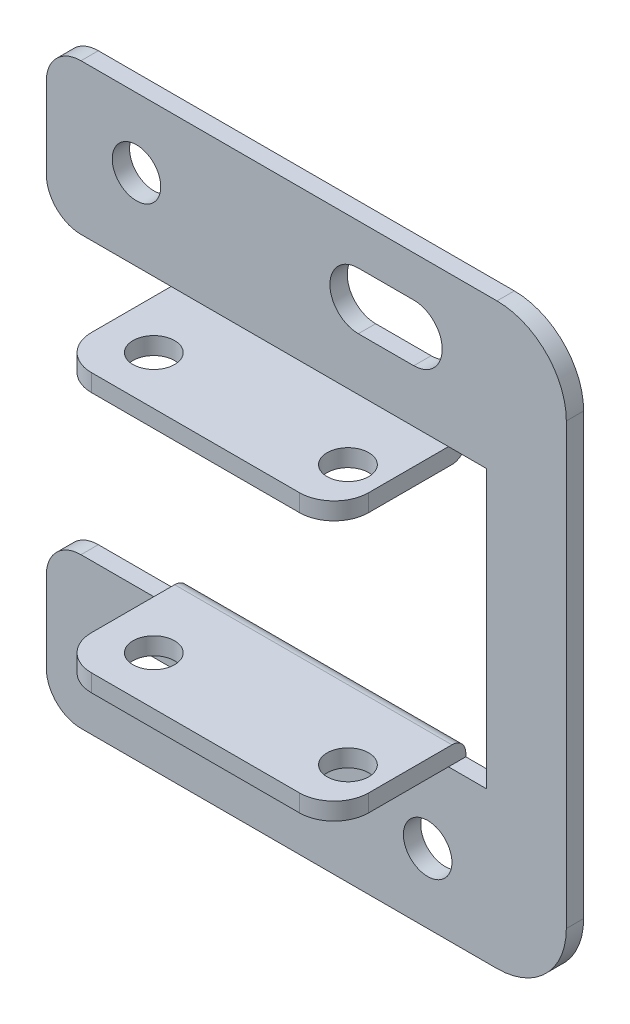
ISO-10303-21;
HEADER;
FILE_DESCRIPTION(('STEP AP214'),'2;1');
FILE_NAME('part.step','',(''),(''),'','','');
FILE_SCHEMA(('AUTOMOTIVE_DESIGN { 1 0 10303 214 1 1 1 1 }'));
ENDSEC;
DATA;
#1=APPLICATION_CONTEXT('core data for automotive mechanical design processes');
#2=APPLICATION_PROTOCOL_DEFINITION('international standard','automotive_design',2000,#1);
#3=PRODUCT_CONTEXT('',#1,'mechanical');
#4=PRODUCT('Part','Part','',(#3));
#5=PRODUCT_RELATED_PRODUCT_CATEGORY('part','',(#4));
#6=PRODUCT_DEFINITION_FORMATION('','',#4);
#7=PRODUCT_DEFINITION_CONTEXT('part definition',#1,'design');
#8=PRODUCT_DEFINITION('design','',#6,#7);
#9=PRODUCT_DEFINITION_SHAPE('','',#8);
#10=(LENGTH_UNIT() NAMED_UNIT(*) SI_UNIT(.MILLI.,.METRE.));
#11=(NAMED_UNIT(*) PLANE_ANGLE_UNIT() SI_UNIT($,.RADIAN.));
#12=(NAMED_UNIT(*) SI_UNIT($,.STERADIAN.) SOLID_ANGLE_UNIT());
#13=UNCERTAINTY_MEASURE_WITH_UNIT(LENGTH_MEASURE(1.E-05),#10,'distance_accuracy_value','');
#14=(GEOMETRIC_REPRESENTATION_CONTEXT(3) GLOBAL_UNCERTAINTY_ASSIGNED_CONTEXT((#13)) GLOBAL_UNIT_ASSIGNED_CONTEXT((#10,
#11,#12)) REPRESENTATION_CONTEXT('',''));
#15=CARTESIAN_POINT('',(0.,0.,0.));
#16=DIRECTION('',(0.,0.,1.));
#17=DIRECTION('',(1.,0.,0.));
#18=AXIS2_PLACEMENT_3D('',#15,#16,#17);
#19=CARTESIAN_POINT('',(9.00000000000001,-10.,7.));
#20=DIRECTION('',(-1.,0.,0.));
#21=DIRECTION('',(0.,0.,1.));
#22=AXIS2_PLACEMENT_3D('',#19,#20,#21);
#23=PLANE('',#22);
#24=DIRECTION('',(0.,1.,0.));
#25=VECTOR('',#24,1.);
#26=CARTESIAN_POINT('',(9.00000000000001,-10.,7.));
#27=LINE('',#26,#25);
#28=CARTESIAN_POINT('',(9.00000000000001,-8.75,7.));
#29=VERTEX_POINT('',#28);
#30=CARTESIAN_POINT('',(9.00000000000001,-10.,7.));
#31=VERTEX_POINT('',#30);
#32=EDGE_CURVE('E276',#29,#31,#27,.F.);
#33=ORIENTED_EDGE('',*,*,#32,.F.);
#34=DIRECTION('',(0.,0.,1.));
#35=VECTOR('',#34,1.);
#36=CARTESIAN_POINT('',(9.00000000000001,-8.75,4.55043997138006));
#37=LINE('',#36,#35);
#38=CARTESIAN_POINT('',(9.00000000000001,-8.75,1.));
#39=VERTEX_POINT('',#38);
#40=EDGE_CURVE('E320',#39,#29,#37,.T.);
#41=ORIENTED_EDGE('',*,*,#40,.F.);
#42=CARTESIAN_POINT('',(9.00000000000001,-9.75,1.));
#43=DIRECTION('',(1.,0.,0.));
#44=DIRECTION('',(0.,1.,0.));
#45=AXIS2_PLACEMENT_3D('',#42,#43,#44);
#46=CIRCLE('',#45,1.);
#47=CARTESIAN_POINT('',(9.00000000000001,-9.75,0.));
#48=VERTEX_POINT('',#47);
#49=EDGE_CURVE('E19',#39,#48,#46,.F.);
#50=ORIENTED_EDGE('',*,*,#49,.T.);
#51=DIRECTION('',(0.,1.,0.));
#52=VECTOR('',#51,1.);
#53=CARTESIAN_POINT('',(9.00000000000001,-10.,0.));
#54=LINE('',#53,#52);
#55=CARTESIAN_POINT('',(9.00000000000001,-10.,0.));
#56=VERTEX_POINT('',#55);
#57=EDGE_CURVE('E271',#48,#56,#54,.F.);
#58=ORIENTED_EDGE('',*,*,#57,.T.);
#59=DIRECTION('',(0.,0.,1.));
#60=VECTOR('',#59,1.);
#61=CARTESIAN_POINT('',(9.00000000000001,-10.,7.));
#62=LINE('',#61,#60);
#63=CARTESIAN_POINT('',(9.00000000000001,-10.,1.25));
#64=VERTEX_POINT('',#63);
#65=EDGE_CURVE('E266',#56,#64,#62,.T.);
#66=ORIENTED_EDGE('',*,*,#65,.T.);
#67=DIRECTION('',(0.,0.,1.));
#68=VECTOR('',#67,1.);
#69=CARTESIAN_POINT('',(9.00000000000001,-10.,4.55043997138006));
#70=LINE('',#69,#68);
#71=EDGE_CURVE('E269',#64,#31,#70,.T.);
#72=ORIENTED_EDGE('',*,*,#71,.T.);
#73=EDGE_LOOP('',(#33,#41,#50,#58,#66,#72));
#74=FACE_BOUND('',#73,.T.);
#75=ADVANCED_FACE('F15',(#74),#23,.T.);
#76=CARTESIAN_POINT('',(11.5,-10.,7.));
#77=DIRECTION('',(0.,1.,0.));
#78=DIRECTION('',(0.,0.,1.));
#79=AXIS2_PLACEMENT_3D('',#76,#77,#78);
#80=CYLINDRICAL_SURFACE('',#79,2.5);
#81=CARTESIAN_POINT('',(11.5,-10.,7.));
#82=DIRECTION('',(0.,1.,0.));
#83=DIRECTION('',(0.,0.,1.));
#84=AXIS2_PLACEMENT_3D('',#81,#82,#83);
#85=CIRCLE('',#84,2.5);
#86=CARTESIAN_POINT('',(11.5,-10.,9.5));
#87=VERTEX_POINT('',#86);
#88=EDGE_CURVE('E287',#31,#87,#85,.T.);
#89=ORIENTED_EDGE('',*,*,#88,.T.);
#90=DIRECTION('',(0.,1.,0.));
#91=VECTOR('',#90,1.);
#92=CARTESIAN_POINT('',(11.5,-10.,9.5));
#93=LINE('',#92,#91);
#94=CARTESIAN_POINT('',(11.5,-8.75,9.5));
#95=VERTEX_POINT('',#94);
#96=EDGE_CURVE('E378',#95,#87,#93,.F.);
#97=ORIENTED_EDGE('',*,*,#96,.F.);
#98=CARTESIAN_POINT('',(11.5,-8.75,7.));
#99=DIRECTION('',(0.,1.,0.));
#100=DIRECTION('',(0.,0.,1.));
#101=AXIS2_PLACEMENT_3D('',#98,#99,#100);
#102=CIRCLE('',#101,2.5);
#103=EDGE_CURVE('E319',#29,#95,#102,.T.);
#104=ORIENTED_EDGE('',*,*,#103,.F.);
#105=ORIENTED_EDGE('',*,*,#32,.T.);
#106=EDGE_LOOP('',(#89,#97,#104,#105));
#107=FACE_BOUND('',#106,.T.);
#108=ADVANCED_FACE('F778',(#107),#80,.T.);
#109=CARTESIAN_POINT('',(26.5,-10.,9.5));
#110=DIRECTION('',(0.,0.,1.));
#111=DIRECTION('',(1.,0.,0.));
#112=AXIS2_PLACEMENT_3D('',#109,#110,#111);
#113=PLANE('',#112);
#114=DIRECTION('',(1.,0.,0.));
#115=VECTOR('',#114,1.);
#116=CARTESIAN_POINT('',(19.,-10.,9.5));
#117=LINE('',#116,#115);
#118=CARTESIAN_POINT('',(26.5,-10.,9.5));
#119=VERTEX_POINT('',#118);
#120=EDGE_CURVE('E345',#87,#119,#117,.T.);
#121=ORIENTED_EDGE('',*,*,#120,.T.);
#122=DIRECTION('',(0.,1.,0.));
#123=VECTOR('',#122,1.);
#124=CARTESIAN_POINT('',(26.5,-10.,9.5));
#125=LINE('',#124,#123);
#126=CARTESIAN_POINT('',(26.5,-8.75,9.5));
#127=VERTEX_POINT('',#126);
#128=EDGE_CURVE('E376',#127,#119,#125,.F.);
#129=ORIENTED_EDGE('',*,*,#128,.F.);
#130=DIRECTION('',(1.,0.,0.));
#131=VECTOR('',#130,1.);
#132=CARTESIAN_POINT('',(19.,-8.75,9.5));
#133=LINE('',#132,#131);
#134=EDGE_CURVE('E317',#95,#127,#133,.T.);
#135=ORIENTED_EDGE('',*,*,#134,.F.);
#136=ORIENTED_EDGE('',*,*,#96,.T.);
#137=EDGE_LOOP('',(#121,#129,#135,#136));
#138=FACE_BOUND('',#137,.T.);
#139=ADVANCED_FACE('F774',(#138),#113,.T.);
#140=CARTESIAN_POINT('',(26.5,-10.,7.));
#141=DIRECTION('',(0.,1.,0.));
#142=DIRECTION('',(0.,0.,1.));
#143=AXIS2_PLACEMENT_3D('',#140,#141,#142);
#144=CYLINDRICAL_SURFACE('',#143,2.5);
#145=CARTESIAN_POINT('',(26.5,-10.,7.));
#146=DIRECTION('',(0.,1.,0.));
#147=DIRECTION('',(0.,0.,1.));
#148=AXIS2_PLACEMENT_3D('',#145,#146,#147);
#149=CIRCLE('',#148,2.5);
#150=CARTESIAN_POINT('',(29.,-10.,7.));
#151=VERTEX_POINT('',#150);
#152=EDGE_CURVE('E344',#119,#151,#149,.T.);
#153=ORIENTED_EDGE('',*,*,#152,.T.);
#154=DIRECTION('',(0.,1.,0.));
#155=VECTOR('',#154,1.);
#156=CARTESIAN_POINT('',(29.,-10.,7.));
#157=LINE('',#156,#155);
#158=CARTESIAN_POINT('',(29.,-8.75,7.));
#159=VERTEX_POINT('',#158);
#160=EDGE_CURVE('E373',#159,#151,#157,.F.);
#161=ORIENTED_EDGE('',*,*,#160,.F.);
#162=CARTESIAN_POINT('',(26.5,-8.75,7.));
#163=DIRECTION('',(0.,1.,0.));
#164=DIRECTION('',(0.,0.,1.));
#165=AXIS2_PLACEMENT_3D('',#162,#163,#164);
#166=CIRCLE('',#165,2.5);
#167=EDGE_CURVE('E316',#127,#159,#166,.T.);
#168=ORIENTED_EDGE('',*,*,#167,.F.);
#169=ORIENTED_EDGE('',*,*,#128,.T.);
#170=EDGE_LOOP('',(#153,#161,#168,#169));
#171=FACE_BOUND('',#170,.T.);
#172=ADVANCED_FACE('F771',(#171),#144,.T.);
#173=CARTESIAN_POINT('',(29.,-10.,0.));
#174=DIRECTION('',(1.,0.,0.));
#175=DIRECTION('',(0.,0.,-1.));
#176=AXIS2_PLACEMENT_3D('',#173,#174,#175);
#177=PLANE('',#176);
#178=DIRECTION('',(0.,0.,-1.));
#179=VECTOR('',#178,1.);
#180=CARTESIAN_POINT('',(29.,-10.,0.));
#181=LINE('',#180,#179);
#182=CARTESIAN_POINT('',(29.,-10.,1.25));
#183=VERTEX_POINT('',#182);
#184=CARTESIAN_POINT('',(29.,-10.,0.));
#185=VERTEX_POINT('',#184);
#186=EDGE_CURVE('E372',#183,#185,#181,.T.);
#187=ORIENTED_EDGE('',*,*,#186,.T.);
#188=DIRECTION('',(0.,1.,0.));
#189=VECTOR('',#188,1.);
#190=CARTESIAN_POINT('',(29.,-10.,0.));
#191=LINE('',#190,#189);
#192=CARTESIAN_POINT('',(29.,-9.75,0.));
#193=VERTEX_POINT('',#192);
#194=EDGE_CURVE('E370',#185,#193,#191,.T.);
#195=ORIENTED_EDGE('',*,*,#194,.T.);
#196=CARTESIAN_POINT('',(29.,-9.75,1.));
#197=DIRECTION('',(1.,0.,0.));
#198=DIRECTION('',(0.,1.,0.));
#199=AXIS2_PLACEMENT_3D('',#196,#197,#198);
#200=CIRCLE('',#199,1.);
#201=CARTESIAN_POINT('',(29.,-8.75,1.));
#202=VERTEX_POINT('',#201);
#203=EDGE_CURVE('E374',#193,#202,#200,.T.);
#204=ORIENTED_EDGE('',*,*,#203,.T.);
#205=DIRECTION('',(0.,0.,1.));
#206=VECTOR('',#205,1.);
#207=CARTESIAN_POINT('',(29.,-8.75,4.55043997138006));
#208=LINE('',#207,#206);
#209=EDGE_CURVE('E312',#159,#202,#208,.F.);
#210=ORIENTED_EDGE('',*,*,#209,.F.);
#211=ORIENTED_EDGE('',*,*,#160,.T.);
#212=DIRECTION('',(0.,0.,1.));
#213=VECTOR('',#212,1.);
#214=CARTESIAN_POINT('',(29.,-10.,4.55043997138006));
#215=LINE('',#214,#213);
#216=EDGE_CURVE('E340',#151,#183,#215,.F.);
#217=ORIENTED_EDGE('',*,*,#216,.T.);
#218=EDGE_LOOP('',(#187,#195,#204,#210,#211,#217));
#219=FACE_BOUND('',#218,.T.);
#220=ADVANCED_FACE('F517',(#219),#177,.T.);
#221=CARTESIAN_POINT('',(26.5,-10.,6.));
#222=DIRECTION('',(0.,1.,0.));
#223=DIRECTION('',(0.,0.,1.));
#224=AXIS2_PLACEMENT_3D('',#221,#222,#223);
#225=CYLINDRICAL_SURFACE('',#224,1.5);
#226=CARTESIAN_POINT('',(26.5,-10.,6.));
#227=DIRECTION('',(0.,1.,0.));
#228=DIRECTION('',(0.,0.,1.));
#229=AXIS2_PLACEMENT_3D('',#226,#227,#228);
#230=CIRCLE('',#229,1.5);
#231=CARTESIAN_POINT('',(26.5,-10.,7.5));
#232=VERTEX_POINT('',#231);
#233=EDGE_CURVE('E335',#232,#232,#230,.F.);
#234=ORIENTED_EDGE('',*,*,#233,.T.);
#235=EDGE_LOOP('',(#234));
#236=FACE_BOUND('',#235,.T.);
#237=CARTESIAN_POINT('',(26.5,-8.75,6.));
#238=DIRECTION('',(0.,1.,0.));
#239=DIRECTION('',(0.,0.,1.));
#240=AXIS2_PLACEMENT_3D('',#237,#238,#239);
#241=CIRCLE('',#240,1.5);
#242=CARTESIAN_POINT('',(26.5,-8.75,7.5));
#243=VERTEX_POINT('',#242);
#244=EDGE_CURVE('E315',#243,#243,#241,.F.);
#245=ORIENTED_EDGE('',*,*,#244,.F.);
#246=EDGE_LOOP('',(#245));
#247=FACE_BOUND('',#246,.T.);
#248=ADVANCED_FACE('F764',(#236,#247),#225,.F.);
#249=CARTESIAN_POINT('',(12.5,-10.,6.));
#250=DIRECTION('',(0.,1.,0.));
#251=DIRECTION('',(0.,0.,1.));
#252=AXIS2_PLACEMENT_3D('',#249,#250,#251);
#253=CYLINDRICAL_SURFACE('',#252,1.5);
#254=CARTESIAN_POINT('',(12.5,-10.,6.));
#255=DIRECTION('',(0.,1.,0.));
#256=DIRECTION('',(0.,0.,1.));
#257=AXIS2_PLACEMENT_3D('',#254,#255,#256);
#258=CIRCLE('',#257,1.5);
#259=CARTESIAN_POINT('',(12.5,-10.,7.5));
#260=VERTEX_POINT('',#259);
#261=EDGE_CURVE('E343',#260,#260,#258,.F.);
#262=ORIENTED_EDGE('',*,*,#261,.T.);
#263=EDGE_LOOP('',(#262));
#264=FACE_BOUND('',#263,.T.);
#265=CARTESIAN_POINT('',(12.5,-8.75,6.));
#266=DIRECTION('',(0.,1.,0.));
#267=DIRECTION('',(0.,0.,1.));
#268=AXIS2_PLACEMENT_3D('',#265,#266,#267);
#269=CIRCLE('',#268,1.5);
#270=CARTESIAN_POINT('',(12.5,-8.75,7.5));
#271=VERTEX_POINT('',#270);
#272=EDGE_CURVE('E491',#271,#271,#269,.F.);
#273=ORIENTED_EDGE('',*,*,#272,.F.);
#274=EDGE_LOOP('',(#273));
#275=FACE_BOUND('',#274,.T.);
#276=ADVANCED_FACE('F760',(#264,#275),#253,.F.);
#277=CARTESIAN_POINT('',(29.,8.75,7.));
#278=DIRECTION('',(1.,0.,0.));
#279=DIRECTION('',(0.,0.,-1.));
#280=AXIS2_PLACEMENT_3D('',#277,#278,#279);
#281=PLANE('',#280);
#282=DIRECTION('',(0.,1.,0.));
#283=VECTOR('',#282,1.);
#284=CARTESIAN_POINT('',(29.,9.375,7.));
#285=LINE('',#284,#283);
#286=CARTESIAN_POINT('',(29.,8.75,7.));
#287=VERTEX_POINT('',#286);
#288=CARTESIAN_POINT('',(29.,10.,7.));
#289=VERTEX_POINT('',#288);
#290=EDGE_CURVE('E364',#287,#289,#285,.T.);
#291=ORIENTED_EDGE('',*,*,#290,.F.);
#292=DIRECTION('',(0.,0.,1.));
#293=VECTOR('',#292,1.);
#294=CARTESIAN_POINT('',(29.,8.75,5.25));
#295=LINE('',#294,#293);
#296=CARTESIAN_POINT('',(29.,8.75,1.));
#297=VERTEX_POINT('',#296);
#298=EDGE_CURVE('E490',#297,#287,#295,.T.);
#299=ORIENTED_EDGE('',*,*,#298,.F.);
#300=CARTESIAN_POINT('',(29.,9.75,1.));
#301=DIRECTION('',(1.,0.,0.));
#302=DIRECTION('',(0.,1.,0.));
#303=AXIS2_PLACEMENT_3D('',#300,#301,#302);
#304=CIRCLE('',#303,1.);
#305=CARTESIAN_POINT('',(29.,9.75,0.));
#306=VERTEX_POINT('',#305);
#307=EDGE_CURVE('E369',#297,#306,#304,.T.);
#308=ORIENTED_EDGE('',*,*,#307,.T.);
#309=DIRECTION('',(0.,1.,0.));
#310=VECTOR('',#309,1.);
#311=CARTESIAN_POINT('',(29.,9.375,0.));
#312=LINE('',#311,#310);
#313=CARTESIAN_POINT('',(29.,10.,0.));
#314=VERTEX_POINT('',#313);
#315=EDGE_CURVE('E367',#306,#314,#312,.T.);
#316=ORIENTED_EDGE('',*,*,#315,.T.);
#317=DIRECTION('',(0.,0.,1.));
#318=VECTOR('',#317,1.);
#319=CARTESIAN_POINT('',(29.,10.,3.5));
#320=LINE('',#319,#318);
#321=CARTESIAN_POINT('',(29.,10.,1.25));
#322=VERTEX_POINT('',#321);
#323=EDGE_CURVE('E366',#314,#322,#320,.T.);
#324=ORIENTED_EDGE('',*,*,#323,.T.);
#325=DIRECTION('',(0.,0.,1.));
#326=VECTOR('',#325,1.);
#327=CARTESIAN_POINT('',(29.,10.,5.375));
#328=LINE('',#327,#326);
#329=EDGE_CURVE('E332',#322,#289,#328,.T.);
#330=ORIENTED_EDGE('',*,*,#329,.T.);
#331=EDGE_LOOP('',(#291,#299,#308,#316,#324,#330));
#332=FACE_BOUND('',#331,.T.);
#333=ADVANCED_FACE('F763',(#332),#281,.T.);
#334=CARTESIAN_POINT('',(26.5,10.,7.));
#335=DIRECTION('',(0.,-1.,0.));
#336=DIRECTION('',(0.,0.,-1.));
#337=AXIS2_PLACEMENT_3D('',#334,#335,#336);
#338=CYLINDRICAL_SURFACE('',#337,2.5);
#339=CARTESIAN_POINT('',(26.5,10.,7.));
#340=DIRECTION('',(0.,-1.,0.));
#341=DIRECTION('',(0.,0.,-1.));
#342=AXIS2_PLACEMENT_3D('',#339,#340,#341);
#343=CIRCLE('',#342,2.5);
#344=CARTESIAN_POINT('',(26.5,10.,9.5));
#345=VERTEX_POINT('',#344);
#346=EDGE_CURVE('E331',#289,#345,#343,.T.);
#347=ORIENTED_EDGE('',*,*,#346,.T.);
#348=DIRECTION('',(0.,1.,0.));
#349=VECTOR('',#348,1.);
#350=CARTESIAN_POINT('',(26.5,9.375,9.5));
#351=LINE('',#350,#349);
#352=CARTESIAN_POINT('',(26.5,8.75,9.5));
#353=VERTEX_POINT('',#352);
#354=EDGE_CURVE('E362',#353,#345,#351,.T.);
#355=ORIENTED_EDGE('',*,*,#354,.F.);
#356=CARTESIAN_POINT('',(26.5,8.75,7.));
#357=DIRECTION('',(0.,-1.,0.));
#358=DIRECTION('',(0.,0.,-1.));
#359=AXIS2_PLACEMENT_3D('',#356,#357,#358);
#360=CIRCLE('',#359,2.5);
#361=EDGE_CURVE('E488',#287,#353,#360,.T.);
#362=ORIENTED_EDGE('',*,*,#361,.F.);
#363=ORIENTED_EDGE('',*,*,#290,.T.);
#364=EDGE_LOOP('',(#347,#355,#362,#363));
#365=FACE_BOUND('',#364,.T.);
#366=ADVANCED_FACE('F787',(#365),#338,.T.);
#367=CARTESIAN_POINT('',(11.5,8.75,9.5));
#368=DIRECTION('',(0.,0.,1.));
#369=DIRECTION('',(1.,0.,0.));
#370=AXIS2_PLACEMENT_3D('',#367,#368,#369);
#371=PLANE('',#370);
#372=DIRECTION('',(-1.,0.,0.));
#373=VECTOR('',#372,1.);
#374=CARTESIAN_POINT('',(19.,10.,9.5));
#375=LINE('',#374,#373);
#376=CARTESIAN_POINT('',(11.5,10.,9.5));
#377=VERTEX_POINT('',#376);
#378=EDGE_CURVE('E328',#345,#377,#375,.T.);
#379=ORIENTED_EDGE('',*,*,#378,.T.);
#380=DIRECTION('',(0.,1.,0.));
#381=VECTOR('',#380,1.);
#382=CARTESIAN_POINT('',(11.5,9.375,9.5));
#383=LINE('',#382,#381);
#384=CARTESIAN_POINT('',(11.5,8.75,9.5));
#385=VERTEX_POINT('',#384);
#386=EDGE_CURVE('E360',#385,#377,#383,.T.);
#387=ORIENTED_EDGE('',*,*,#386,.F.);
#388=DIRECTION('',(-1.,0.,0.));
#389=VECTOR('',#388,1.);
#390=CARTESIAN_POINT('',(19.,8.75,9.5));
#391=LINE('',#390,#389);
#392=EDGE_CURVE('E487',#353,#385,#391,.T.);
#393=ORIENTED_EDGE('',*,*,#392,.F.);
#394=ORIENTED_EDGE('',*,*,#354,.T.);
#395=EDGE_LOOP('',(#379,#387,#393,#394));
#396=FACE_BOUND('',#395,.T.);
#397=ADVANCED_FACE('F791',(#396),#371,.T.);
#398=CARTESIAN_POINT('',(11.5,10.,7.));
#399=DIRECTION('',(0.,-1.,0.));
#400=DIRECTION('',(0.,0.,-1.));
#401=AXIS2_PLACEMENT_3D('',#398,#399,#400);
#402=CYLINDRICAL_SURFACE('',#401,2.5);
#403=CARTESIAN_POINT('',(11.5,10.,7.));
#404=DIRECTION('',(0.,-1.,0.));
#405=DIRECTION('',(0.,0.,-1.));
#406=AXIS2_PLACEMENT_3D('',#403,#404,#405);
#407=CIRCLE('',#406,2.5);
#408=CARTESIAN_POINT('',(9.00000000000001,10.,7.));
#409=VERTEX_POINT('',#408);
#410=EDGE_CURVE('E327',#377,#409,#407,.T.);
#411=ORIENTED_EDGE('',*,*,#410,.T.);
#412=DIRECTION('',(0.,1.,0.));
#413=VECTOR('',#412,1.);
#414=CARTESIAN_POINT('',(9.00000000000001,9.375,7.));
#415=LINE('',#414,#413);
#416=CARTESIAN_POINT('',(9.00000000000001,8.75,7.));
#417=VERTEX_POINT('',#416);
#418=EDGE_CURVE('E352',#417,#409,#415,.T.);
#419=ORIENTED_EDGE('',*,*,#418,.F.);
#420=CARTESIAN_POINT('',(11.5,8.75,7.));
#421=DIRECTION('',(0.,-1.,0.));
#422=DIRECTION('',(0.,0.,-1.));
#423=AXIS2_PLACEMENT_3D('',#420,#421,#422);
#424=CIRCLE('',#423,2.5);
#425=EDGE_CURVE('E485',#385,#417,#424,.T.);
#426=ORIENTED_EDGE('',*,*,#425,.F.);
#427=ORIENTED_EDGE('',*,*,#386,.T.);
#428=EDGE_LOOP('',(#411,#419,#426,#427));
#429=FACE_BOUND('',#428,.T.);
#430=ADVANCED_FACE('F795',(#429),#402,.T.);
#431=CARTESIAN_POINT('',(9.00000000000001,8.75,0.));
#432=DIRECTION('',(-1.,0.,0.));
#433=DIRECTION('',(0.,0.,1.));
#434=AXIS2_PLACEMENT_3D('',#431,#432,#433);
#435=PLANE('',#434);
#436=DIRECTION('',(0.,0.,-1.));
#437=VECTOR('',#436,1.);
#438=CARTESIAN_POINT('',(9.00000000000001,10.,3.5));
#439=LINE('',#438,#437);
#440=CARTESIAN_POINT('',(9.00000000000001,10.,1.25));
#441=VERTEX_POINT('',#440);
#442=CARTESIAN_POINT('',(9.00000000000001,10.,0.));
#443=VERTEX_POINT('',#442);
#444=EDGE_CURVE('E351',#441,#443,#439,.T.);
#445=ORIENTED_EDGE('',*,*,#444,.T.);
#446=DIRECTION('',(0.,-1.,0.));
#447=VECTOR('',#446,1.);
#448=CARTESIAN_POINT('',(9.00000000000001,9.375,0.));
#449=LINE('',#448,#447);
#450=CARTESIAN_POINT('',(9.00000000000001,9.75,0.));
#451=VERTEX_POINT('',#450);
#452=EDGE_CURVE('E288',#443,#451,#449,.T.);
#453=ORIENTED_EDGE('',*,*,#452,.T.);
#454=CARTESIAN_POINT('',(9.00000000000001,9.75,1.));
#455=DIRECTION('',(1.,0.,0.));
#456=DIRECTION('',(0.,1.,0.));
#457=AXIS2_PLACEMENT_3D('',#454,#455,#456);
#458=CIRCLE('',#457,1.);
#459=CARTESIAN_POINT('',(9.00000000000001,8.75,1.));
#460=VERTEX_POINT('',#459);
#461=EDGE_CURVE('E354',#451,#460,#458,.F.);
#462=ORIENTED_EDGE('',*,*,#461,.T.);
#463=DIRECTION('',(0.,0.,-1.));
#464=VECTOR('',#463,1.);
#465=CARTESIAN_POINT('',(9.00000000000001,8.75,5.25));
#466=LINE('',#465,#464);
#467=EDGE_CURVE('E484',#417,#460,#466,.T.);
#468=ORIENTED_EDGE('',*,*,#467,.F.);
#469=ORIENTED_EDGE('',*,*,#418,.T.);
#470=DIRECTION('',(0.,0.,-1.));
#471=VECTOR('',#470,1.);
#472=CARTESIAN_POINT('',(9.00000000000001,10.,5.375));
#473=LINE('',#472,#471);
#474=EDGE_CURVE('E323',#409,#441,#473,.T.);
#475=ORIENTED_EDGE('',*,*,#474,.T.);
#476=EDGE_LOOP('',(#445,#453,#462,#468,#469,#475));
#477=FACE_BOUND('',#476,.T.);
#478=ADVANCED_FACE('F799',(#477),#435,.T.);
#479=CARTESIAN_POINT('',(12.5,10.,6.));
#480=DIRECTION('',(0.,-1.,0.));
#481=DIRECTION('',(0.,0.,-1.));
#482=AXIS2_PLACEMENT_3D('',#479,#480,#481);
#483=CYLINDRICAL_SURFACE('',#482,1.5);
#484=CARTESIAN_POINT('',(12.5,10.,6.));
#485=DIRECTION('',(0.,-1.,0.));
#486=DIRECTION('',(0.,0.,-1.));
#487=AXIS2_PLACEMENT_3D('',#484,#485,#486);
#488=CIRCLE('',#487,1.5);
#489=CARTESIAN_POINT('',(12.5,10.,4.5));
#490=VERTEX_POINT('',#489);
#491=EDGE_CURVE('E322',#490,#490,#488,.F.);
#492=ORIENTED_EDGE('',*,*,#491,.T.);
#493=EDGE_LOOP('',(#492));
#494=FACE_BOUND('',#493,.T.);
#495=CARTESIAN_POINT('',(12.5,8.75,6.));
#496=DIRECTION('',(0.,-1.,0.));
#497=DIRECTION('',(0.,0.,-1.));
#498=AXIS2_PLACEMENT_3D('',#495,#496,#497);
#499=CIRCLE('',#498,1.5);
#500=CARTESIAN_POINT('',(12.5,8.75,4.5));
#501=VERTEX_POINT('',#500);
#502=EDGE_CURVE('E481',#501,#501,#499,.F.);
#503=ORIENTED_EDGE('',*,*,#502,.F.);
#504=EDGE_LOOP('',(#503));
#505=FACE_BOUND('',#504,.T.);
#506=ADVANCED_FACE('F803',(#494,#505),#483,.F.);
#507=CARTESIAN_POINT('',(26.5,10.,6.));
#508=DIRECTION('',(0.,-1.,0.));
#509=DIRECTION('',(0.,0.,-1.));
#510=AXIS2_PLACEMENT_3D('',#507,#508,#509);
#511=CYLINDRICAL_SURFACE('',#510,1.5);
#512=CARTESIAN_POINT('',(26.5,10.,6.));
#513=DIRECTION('',(0.,-1.,0.));
#514=DIRECTION('',(0.,0.,-1.));
#515=AXIS2_PLACEMENT_3D('',#512,#513,#514);
#516=CIRCLE('',#515,1.5);
#517=CARTESIAN_POINT('',(26.5,10.,4.5));
#518=VERTEX_POINT('',#517);
#519=EDGE_CURVE('E326',#518,#518,#516,.F.);
#520=ORIENTED_EDGE('',*,*,#519,.T.);
#521=EDGE_LOOP('',(#520));
#522=FACE_BOUND('',#521,.T.);
#523=CARTESIAN_POINT('',(26.5,8.75,6.00000000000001));
#524=DIRECTION('',(0.,-1.,0.));
#525=DIRECTION('',(0.,0.,-1.));
#526=AXIS2_PLACEMENT_3D('',#523,#524,#525);
#527=CIRCLE('',#526,1.5);
#528=CARTESIAN_POINT('',(26.5,8.75,4.5));
#529=VERTEX_POINT('',#528);
#530=EDGE_CURVE('E298',#529,#529,#527,.F.);
#531=ORIENTED_EDGE('',*,*,#530,.F.);
#532=EDGE_LOOP('',(#531));
#533=FACE_BOUND('',#532,.T.);
#534=ADVANCED_FACE('F758',(#522,#533),#511,.F.);
#535=CARTESIAN_POINT('',(19.,-10.,4.55043997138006));
#536=DIRECTION('',(0.,1.,0.));
#537=DIRECTION('',(0.,0.,1.));
#538=AXIS2_PLACEMENT_3D('',#535,#536,#537);
#539=PLANE('',#538);
#540=ORIENTED_EDGE('',*,*,#233,.F.);
#541=EDGE_LOOP('',(#540));
#542=FACE_BOUND('',#541,.T.);
#543=ORIENTED_EDGE('',*,*,#261,.F.);
#544=EDGE_LOOP('',(#543));
#545=FACE_BOUND('',#544,.T.);
#546=ORIENTED_EDGE('',*,*,#216,.F.);
#547=ORIENTED_EDGE('',*,*,#152,.F.);
#548=ORIENTED_EDGE('',*,*,#120,.F.);
#549=ORIENTED_EDGE('',*,*,#88,.F.);
#550=ORIENTED_EDGE('',*,*,#71,.F.);
#551=DIRECTION('',(1.,0.,0.));
#552=VECTOR('',#551,1.);
#553=CARTESIAN_POINT('',(20.8601711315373,-10.,1.25));
#554=LINE('',#553,#552);
#555=EDGE_CURVE('E284',#183,#64,#554,.F.);
#556=ORIENTED_EDGE('',*,*,#555,.F.);
#557=EDGE_LOOP('',(#546,#547,#548,#549,#550,#556));
#558=FACE_BOUND('',#557,.T.);
#559=ADVANCED_FACE('F283',(#542,#545,#558),#539,.F.);
#560=CARTESIAN_POINT('',(29.,10.,1.25));
#561=DIRECTION('',(0.,-1.,0.));
#562=DIRECTION('',(0.,0.,1.));
#563=AXIS2_PLACEMENT_3D('',#560,#561,#562);
#564=PLANE('',#563);
#565=ORIENTED_EDGE('',*,*,#491,.F.);
#566=EDGE_LOOP('',(#565));
#567=FACE_BOUND('',#566,.T.);
#568=ORIENTED_EDGE('',*,*,#519,.F.);
#569=EDGE_LOOP('',(#568));
#570=FACE_BOUND('',#569,.T.);
#571=ORIENTED_EDGE('',*,*,#474,.F.);
#572=ORIENTED_EDGE('',*,*,#410,.F.);
#573=ORIENTED_EDGE('',*,*,#378,.F.);
#574=ORIENTED_EDGE('',*,*,#346,.F.);
#575=ORIENTED_EDGE('',*,*,#329,.F.);
#576=DIRECTION('',(1.,0.,0.));
#577=VECTOR('',#576,1.);
#578=CARTESIAN_POINT('',(20.8601711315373,10.,1.25));
#579=LINE('',#578,#577);
#580=EDGE_CURVE('E297',#441,#322,#579,.T.);
#581=ORIENTED_EDGE('',*,*,#580,.F.);
#582=EDGE_LOOP('',(#571,#572,#573,#574,#575,#581));
#583=FACE_BOUND('',#582,.T.);
#584=ADVANCED_FACE('F754',(#567,#570,#583),#564,.F.);
#585=CARTESIAN_POINT('',(19.,-8.75,4.55043997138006));
#586=DIRECTION('',(0.,1.,0.));
#587=DIRECTION('',(0.,0.,1.));
#588=AXIS2_PLACEMENT_3D('',#585,#586,#587);
#589=PLANE('',#588);
#590=ORIENTED_EDGE('',*,*,#272,.T.);
#591=EDGE_LOOP('',(#590));
#592=FACE_BOUND('',#591,.T.);
#593=ORIENTED_EDGE('',*,*,#244,.T.);
#594=EDGE_LOOP('',(#593));
#595=FACE_BOUND('',#594,.T.);
#596=ORIENTED_EDGE('',*,*,#167,.T.);
#597=ORIENTED_EDGE('',*,*,#209,.T.);
#598=DIRECTION('',(1.,0.,0.));
#599=VECTOR('',#598,1.);
#600=CARTESIAN_POINT('',(19.9300855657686,-8.75,1.));
#601=LINE('',#600,#599);
#602=EDGE_CURVE('E303',#39,#202,#601,.T.);
#603=ORIENTED_EDGE('',*,*,#602,.F.);
#604=ORIENTED_EDGE('',*,*,#40,.T.);
#605=ORIENTED_EDGE('',*,*,#103,.T.);
#606=ORIENTED_EDGE('',*,*,#134,.T.);
#607=EDGE_LOOP('',(#596,#597,#603,#604,#605,#606));
#608=FACE_BOUND('',#607,.T.);
#609=ADVANCED_FACE('F522',(#592,#595,#608),#589,.T.);
#610=CARTESIAN_POINT('',(29.,8.75,0.999999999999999));
#611=DIRECTION('',(0.,-1.,0.));
#612=DIRECTION('',(0.,0.,1.));
#613=AXIS2_PLACEMENT_3D('',#610,#611,#612);
#614=PLANE('',#613);
#615=ORIENTED_EDGE('',*,*,#530,.T.);
#616=EDGE_LOOP('',(#615));
#617=FACE_BOUND('',#616,.T.);
#618=ORIENTED_EDGE('',*,*,#502,.T.);
#619=EDGE_LOOP('',(#618));
#620=FACE_BOUND('',#619,.T.);
#621=ORIENTED_EDGE('',*,*,#425,.T.);
#622=ORIENTED_EDGE('',*,*,#467,.T.);
#623=DIRECTION('',(1.,0.,0.));
#624=VECTOR('',#623,1.);
#625=CARTESIAN_POINT('',(19.9300855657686,8.75,1.));
#626=LINE('',#625,#624);
#627=EDGE_CURVE('E355',#297,#460,#626,.F.);
#628=ORIENTED_EDGE('',*,*,#627,.F.);
#629=ORIENTED_EDGE('',*,*,#298,.T.);
#630=ORIENTED_EDGE('',*,*,#361,.T.);
#631=ORIENTED_EDGE('',*,*,#392,.T.);
#632=EDGE_LOOP('',(#621,#622,#628,#629,#630,#631));
#633=FACE_BOUND('',#632,.T.);
#634=ADVANCED_FACE('F17',(#617,#620,#633),#614,.T.);
#635=CARTESIAN_POINT('',(20.8601711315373,0.,1.25));
#636=DIRECTION('',(0.,0.,1.));
#637=DIRECTION('',(1.,0.,0.));
#638=AXIS2_PLACEMENT_3D('',#635,#636,#637);
#639=PLANE('',#638);
#640=CARTESIAN_POINT('',(6.5,15.85,1.25));
#641=DIRECTION('',(0.,0.,1.));
#642=DIRECTION('',(1.,0.,0.));
#643=AXIS2_PLACEMENT_3D('',#640,#641,#642);
#644=CIRCLE('',#643,1.75);
#645=CARTESIAN_POINT('',(8.25,15.85,1.25));
#646=VERTEX_POINT('',#645);
#647=EDGE_CURVE('E358',#646,#646,#644,.F.);
#648=ORIENTED_EDGE('',*,*,#647,.T.);
#649=EDGE_LOOP('',(#648));
#650=FACE_BOUND('',#649,.T.);
#651=CARTESIAN_POINT('',(27.5,-15.85,1.25));
#652=DIRECTION('',(0.,0.,1.));
#653=DIRECTION('',(1.,0.,0.));
#654=AXIS2_PLACEMENT_3D('',#651,#652,#653);
#655=CIRCLE('',#654,1.75);
#656=CARTESIAN_POINT('',(29.25,-15.85,1.25));
#657=VERTEX_POINT('',#656);
#658=EDGE_CURVE('E454',#657,#657,#655,.F.);
#659=ORIENTED_EDGE('',*,*,#658,.T.);
#660=EDGE_LOOP('',(#659));
#661=FACE_BOUND('',#660,.T.);
#662=DIRECTION('',(1.,0.,0.));
#663=VECTOR('',#662,1.);
#664=CARTESIAN_POINT('',(26.5,13.8,1.25));
#665=LINE('',#664,#663);
#666=CARTESIAN_POINT('',(26.5,13.8,1.25));
#667=VERTEX_POINT('',#666);
#668=CARTESIAN_POINT('',(22.5,13.8,1.25));
#669=VERTEX_POINT('',#668);
#670=EDGE_CURVE('E669',#667,#669,#665,.F.);
#671=ORIENTED_EDGE('',*,*,#670,.T.);
#672=CARTESIAN_POINT('',(22.5,15.85,1.25));
#673=DIRECTION('',(0.,0.,1.));
#674=DIRECTION('',(1.,0.,0.));
#675=AXIS2_PLACEMENT_3D('',#672,#673,#674);
#676=CIRCLE('',#675,2.05);
#677=CARTESIAN_POINT('',(22.5,17.9,1.25));
#678=VERTEX_POINT('',#677);
#679=EDGE_CURVE('E447',#669,#678,#676,.F.);
#680=ORIENTED_EDGE('',*,*,#679,.T.);
#681=DIRECTION('',(1.,0.,0.));
#682=VECTOR('',#681,1.);
#683=CARTESIAN_POINT('',(22.5,17.9,1.25));
#684=LINE('',#683,#682);
#685=CARTESIAN_POINT('',(26.5,17.9,1.25));
#686=VERTEX_POINT('',#685);
#687=EDGE_CURVE('E664',#678,#686,#684,.T.);
#688=ORIENTED_EDGE('',*,*,#687,.T.);
#689=CARTESIAN_POINT('',(26.5,15.85,1.25));
#690=DIRECTION('',(0.,0.,1.));
#691=DIRECTION('',(1.,0.,0.));
#692=AXIS2_PLACEMENT_3D('',#689,#690,#691);
#693=CIRCLE('',#692,2.05);
#694=EDGE_CURVE('E451',#686,#667,#693,.F.);
#695=ORIENTED_EDGE('',*,*,#694,.T.);
#696=EDGE_LOOP('',(#671,#680,#688,#695));
#697=FACE_BOUND('',#696,.T.);
#698=CARTESIAN_POINT('',(9.,-15.85,1.25));
#699=DIRECTION('',(0.,0.,1.));
#700=DIRECTION('',(1.,0.,0.));
#701=AXIS2_PLACEMENT_3D('',#698,#699,#700);
#702=CIRCLE('',#701,2.05);
#703=CARTESIAN_POINT('',(9.,-13.8,1.25));
#704=VERTEX_POINT('',#703);
#705=CARTESIAN_POINT('',(9.,-17.9,1.25));
#706=VERTEX_POINT('',#705);
#707=EDGE_CURVE('E443',#704,#706,#702,.F.);
#708=ORIENTED_EDGE('',*,*,#707,.T.);
#709=DIRECTION('',(1.,0.,0.));
#710=VECTOR('',#709,1.);
#711=CARTESIAN_POINT('',(9.,-17.9,1.25));
#712=LINE('',#711,#710);
#713=CARTESIAN_POINT('',(5.,-17.9,1.25));
#714=VERTEX_POINT('',#713);
#715=EDGE_CURVE('E654',#706,#714,#712,.F.);
#716=ORIENTED_EDGE('',*,*,#715,.T.);
#717=CARTESIAN_POINT('',(5.,-15.85,1.25));
#718=DIRECTION('',(0.,0.,1.));
#719=DIRECTION('',(1.,0.,0.));
#720=AXIS2_PLACEMENT_3D('',#717,#718,#719);
#721=CIRCLE('',#720,2.05);
#722=CARTESIAN_POINT('',(5.,-13.8,1.25));
#723=VERTEX_POINT('',#722);
#724=EDGE_CURVE('E394',#714,#723,#721,.F.);
#725=ORIENTED_EDGE('',*,*,#724,.T.);
#726=DIRECTION('',(1.,0.,0.));
#727=VECTOR('',#726,1.);
#728=CARTESIAN_POINT('',(5.,-13.8,1.25));
#729=LINE('',#728,#727);
#730=EDGE_CURVE('E660',#723,#704,#729,.T.);
#731=ORIENTED_EDGE('',*,*,#730,.T.);
#732=EDGE_LOOP('',(#708,#716,#725,#731));
#733=FACE_BOUND('',#732,.T.);
#734=ORIENTED_EDGE('',*,*,#580,.T.);
#735=DIRECTION('',(1.,0.,0.));
#736=VECTOR('',#735,1.);
#737=CARTESIAN_POINT('',(31.75,10.,1.25));
#738=LINE('',#737,#736);
#739=CARTESIAN_POINT('',(31.75,10.,1.25));
#740=VERTEX_POINT('',#739);
#741=EDGE_CURVE('E336',#740,#322,#738,.F.);
#742=ORIENTED_EDGE('',*,*,#741,.F.);
#743=DIRECTION('',(0.,1.,0.));
#744=VECTOR('',#743,1.);
#745=CARTESIAN_POINT('',(31.75,-10.,1.25));
#746=LINE('',#745,#744);
#747=CARTESIAN_POINT('',(31.75,-10.,1.25));
#748=VERTEX_POINT('',#747);
#749=EDGE_CURVE('E339',#748,#740,#746,.T.);
#750=ORIENTED_EDGE('',*,*,#749,.F.);
#751=DIRECTION('',(1.,0.,0.));
#752=VECTOR('',#751,1.);
#753=CARTESIAN_POINT('',(2.5,-10.,1.25));
#754=LINE('',#753,#752);
#755=EDGE_CURVE('E243',#183,#748,#754,.T.);
#756=ORIENTED_EDGE('',*,*,#755,.F.);
#757=ORIENTED_EDGE('',*,*,#555,.T.);
#758=DIRECTION('',(1.,0.,0.));
#759=VECTOR('',#758,1.);
#760=CARTESIAN_POINT('',(2.5,-10.,1.25));
#761=LINE('',#760,#759);
#762=CARTESIAN_POINT('',(2.5,-10.,1.25));
#763=VERTEX_POINT('',#762);
#764=EDGE_CURVE('E295',#763,#64,#761,.T.);
#765=ORIENTED_EDGE('',*,*,#764,.F.);
#766=CARTESIAN_POINT('',(2.5,-12.5,1.25));
#767=DIRECTION('',(0.,0.,1.));
#768=DIRECTION('',(1.,0.,0.));
#769=AXIS2_PLACEMENT_3D('',#766,#767,#768);
#770=CIRCLE('',#769,2.5);
#771=CARTESIAN_POINT('',(0.,-12.5,1.25));
#772=VERTEX_POINT('',#771);
#773=EDGE_CURVE('E302',#772,#763,#770,.F.);
#774=ORIENTED_EDGE('',*,*,#773,.F.);
#775=DIRECTION('',(0.,1.,0.));
#776=VECTOR('',#775,1.);
#777=CARTESIAN_POINT('',(0.,-18.35,1.25));
#778=LINE('',#777,#776);
#779=CARTESIAN_POINT('',(0.,-18.35,1.25));
#780=VERTEX_POINT('',#779);
#781=EDGE_CURVE('E309',#780,#772,#778,.T.);
#782=ORIENTED_EDGE('',*,*,#781,.F.);
#783=CARTESIAN_POINT('',(2.5,-18.35,1.25));
#784=DIRECTION('',(0.,0.,1.));
#785=DIRECTION('',(1.,0.,0.));
#786=AXIS2_PLACEMENT_3D('',#783,#784,#785);
#787=CIRCLE('',#786,2.5);
#788=CARTESIAN_POINT('',(2.5,-20.85,1.25));
#789=VERTEX_POINT('',#788);
#790=EDGE_CURVE('E475',#789,#780,#787,.F.);
#791=ORIENTED_EDGE('',*,*,#790,.F.);
#792=DIRECTION('',(1.,0.,0.));
#793=VECTOR('',#792,1.);
#794=CARTESIAN_POINT('',(32.5,-20.85,1.25));
#795=LINE('',#794,#793);
#796=CARTESIAN_POINT('',(32.5,-20.85,1.25));
#797=VERTEX_POINT('',#796);
#798=EDGE_CURVE('E685',#797,#789,#795,.F.);
#799=ORIENTED_EDGE('',*,*,#798,.F.);
#800=CARTESIAN_POINT('',(32.5,-15.85,1.25));
#801=DIRECTION('',(0.,0.,1.));
#802=DIRECTION('',(1.,0.,0.));
#803=AXIS2_PLACEMENT_3D('',#800,#801,#802);
#804=CIRCLE('',#803,5.00000000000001);
#805=CARTESIAN_POINT('',(37.5,-15.85,1.25));
#806=VERTEX_POINT('',#805);
#807=EDGE_CURVE('E471',#806,#797,#804,.F.);
#808=ORIENTED_EDGE('',*,*,#807,.F.);
#809=DIRECTION('',(0.,1.,0.));
#810=VECTOR('',#809,1.);
#811=CARTESIAN_POINT('',(37.5,15.85,1.25));
#812=LINE('',#811,#810);
#813=CARTESIAN_POINT('',(37.5,15.85,1.25));
#814=VERTEX_POINT('',#813);
#815=EDGE_CURVE('E682',#814,#806,#812,.F.);
#816=ORIENTED_EDGE('',*,*,#815,.F.);
#817=CARTESIAN_POINT('',(32.5,15.85,1.25));
#818=DIRECTION('',(0.,0.,1.));
#819=DIRECTION('',(1.,0.,0.));
#820=AXIS2_PLACEMENT_3D('',#817,#818,#819);
#821=CIRCLE('',#820,5.);
#822=CARTESIAN_POINT('',(32.5,20.85,1.25));
#823=VERTEX_POINT('',#822);
#824=EDGE_CURVE('E467',#823,#814,#821,.F.);
#825=ORIENTED_EDGE('',*,*,#824,.F.);
#826=DIRECTION('',(1.,0.,0.));
#827=VECTOR('',#826,1.);
#828=CARTESIAN_POINT('',(2.5,20.85,1.25));
#829=LINE('',#828,#827);
#830=CARTESIAN_POINT('',(2.5,20.85,1.25));
#831=VERTEX_POINT('',#830);
#832=EDGE_CURVE('E679',#831,#823,#829,.T.);
#833=ORIENTED_EDGE('',*,*,#832,.F.);
#834=CARTESIAN_POINT('',(2.5,18.35,1.25));
#835=DIRECTION('',(0.,0.,1.));
#836=DIRECTION('',(1.,0.,0.));
#837=AXIS2_PLACEMENT_3D('',#834,#835,#836);
#838=CIRCLE('',#837,2.5);
#839=CARTESIAN_POINT('',(0.,18.35,1.25));
#840=VERTEX_POINT('',#839);
#841=EDGE_CURVE('E463',#840,#831,#838,.F.);
#842=ORIENTED_EDGE('',*,*,#841,.F.);
#843=DIRECTION('',(0.,1.,0.));
#844=VECTOR('',#843,1.);
#845=CARTESIAN_POINT('',(0.,12.5,1.25));
#846=LINE('',#845,#844);
#847=CARTESIAN_POINT('',(0.,12.5,1.25));
#848=VERTEX_POINT('',#847);
#849=EDGE_CURVE('E676',#848,#840,#846,.T.);
#850=ORIENTED_EDGE('',*,*,#849,.F.);
#851=CARTESIAN_POINT('',(2.5,12.5,1.25));
#852=DIRECTION('',(0.,0.,1.));
#853=DIRECTION('',(1.,0.,0.));
#854=AXIS2_PLACEMENT_3D('',#851,#852,#853);
#855=CIRCLE('',#854,2.5);
#856=CARTESIAN_POINT('',(2.5,10.,1.25));
#857=VERTEX_POINT('',#856);
#858=EDGE_CURVE('E459',#857,#848,#855,.F.);
#859=ORIENTED_EDGE('',*,*,#858,.F.);
#860=DIRECTION('',(1.,0.,0.));
#861=VECTOR('',#860,1.);
#862=CARTESIAN_POINT('',(31.75,10.,1.25));
#863=LINE('',#862,#861);
#864=EDGE_CURVE('E673',#441,#857,#863,.F.);
#865=ORIENTED_EDGE('',*,*,#864,.F.);
#866=EDGE_LOOP('',(#734,#742,#750,#756,#757,#765,#774,#782,#791,#799,#808,#816,#825,#833,#842,
#850,#859,#865));
#867=FACE_BOUND('',#866,.T.);
#868=ADVANCED_FACE('F293',(#650,#661,#697,#733,#867),#639,.T.);
#869=CARTESIAN_POINT('',(31.75,10.,0.));
#870=DIRECTION('',(0.,-1.,0.));
#871=DIRECTION('',(0.,0.,-1.));
#872=AXIS2_PLACEMENT_3D('',#869,#870,#871);
#873=PLANE('',#872);
#874=DIRECTION('',(0.,0.,1.));
#875=VECTOR('',#874,1.);
#876=CARTESIAN_POINT('',(31.75,10.,0.));
#877=LINE('',#876,#875);
#878=CARTESIAN_POINT('',(31.75,10.,0.));
#879=VERTEX_POINT('',#878);
#880=EDGE_CURVE('E349',#740,#879,#877,.F.);
#881=ORIENTED_EDGE('',*,*,#880,.F.);
#882=ORIENTED_EDGE('',*,*,#741,.T.);
#883=ORIENTED_EDGE('',*,*,#323,.F.);
#884=DIRECTION('',(1.,0.,0.));
#885=VECTOR('',#884,1.);
#886=CARTESIAN_POINT('',(20.8601711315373,10.,0.));
#887=LINE('',#886,#885);
#888=EDGE_CURVE('E390',#314,#879,#887,.T.);
#889=ORIENTED_EDGE('',*,*,#888,.T.);
#890=EDGE_LOOP('',(#881,#882,#883,#889));
#891=FACE_BOUND('',#890,.T.);
#892=ADVANCED_FACE('F739',(#891),#873,.T.);
#893=CARTESIAN_POINT('',(31.75,-10.,0.));
#894=DIRECTION('',(-1.,0.,0.));
#895=DIRECTION('',(0.,0.,1.));
#896=AXIS2_PLACEMENT_3D('',#893,#894,#895);
#897=PLANE('',#896);
#898=DIRECTION('',(0.,1.,0.));
#899=VECTOR('',#898,1.);
#900=CARTESIAN_POINT('',(31.75,0.,0.));
#901=LINE('',#900,#899);
#902=CARTESIAN_POINT('',(31.75,-10.,0.));
#903=VERTEX_POINT('',#902);
#904=EDGE_CURVE('E393',#879,#903,#901,.F.);
#905=ORIENTED_EDGE('',*,*,#904,.T.);
#906=DIRECTION('',(0.,0.,1.));
#907=VECTOR('',#906,1.);
#908=CARTESIAN_POINT('',(31.75,-10.,0.));
#909=LINE('',#908,#907);
#910=EDGE_CURVE('E306',#748,#903,#909,.F.);
#911=ORIENTED_EDGE('',*,*,#910,.F.);
#912=ORIENTED_EDGE('',*,*,#749,.T.);
#913=ORIENTED_EDGE('',*,*,#880,.T.);
#914=EDGE_LOOP('',(#905,#911,#912,#913));
#915=FACE_BOUND('',#914,.T.);
#916=ADVANCED_FACE('F536',(#915),#897,.T.);
#917=CARTESIAN_POINT('',(2.5,-10.,0.));
#918=DIRECTION('',(0.,1.,0.));
#919=DIRECTION('',(0.,0.,1.));
#920=AXIS2_PLACEMENT_3D('',#917,#918,#919);
#921=PLANE('',#920);
#922=ORIENTED_EDGE('',*,*,#910,.T.);
#923=DIRECTION('',(1.,0.,0.));
#924=VECTOR('',#923,1.);
#925=CARTESIAN_POINT('',(20.8601711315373,-10.,0.));
#926=LINE('',#925,#924);
#927=EDGE_CURVE('E398',#903,#185,#926,.F.);
#928=ORIENTED_EDGE('',*,*,#927,.T.);
#929=ORIENTED_EDGE('',*,*,#186,.F.);
#930=ORIENTED_EDGE('',*,*,#755,.T.);
#931=EDGE_LOOP('',(#922,#928,#929,#930));
#932=FACE_BOUND('',#931,.T.);
#933=ADVANCED_FACE('F527',(#932),#921,.T.);
#934=CARTESIAN_POINT('',(19.9300855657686,-9.75,1.));
#935=DIRECTION('',(1.,0.,0.));
#936=DIRECTION('',(0.,1.,0.));
#937=AXIS2_PLACEMENT_3D('',#934,#935,#936);
#938=CYLINDRICAL_SURFACE('',#937,1.);
#939=ORIENTED_EDGE('',*,*,#203,.F.);
#940=DIRECTION('',(1.,0.,0.));
#941=VECTOR('',#940,1.);
#942=CARTESIAN_POINT('',(20.8601711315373,-9.75,0.));
#943=LINE('',#942,#941);
#944=EDGE_CURVE('E395',#193,#48,#943,.F.);
#945=ORIENTED_EDGE('',*,*,#944,.T.);
#946=ORIENTED_EDGE('',*,*,#49,.F.);
#947=ORIENTED_EDGE('',*,*,#602,.T.);
#948=EDGE_LOOP('',(#939,#945,#946,#947));
#949=FACE_BOUND('',#948,.T.);
#950=ADVANCED_FACE('F525',(#949),#938,.T.);
#951=CARTESIAN_POINT('',(2.5,-10.,0.));
#952=DIRECTION('',(0.,1.,0.));
#953=DIRECTION('',(0.,0.,1.));
#954=AXIS2_PLACEMENT_3D('',#951,#952,#953);
#955=PLANE('',#954);
#956=DIRECTION('',(0.,0.,1.));
#957=VECTOR('',#956,1.);
#958=CARTESIAN_POINT('',(2.5,-10.,0.));
#959=LINE('',#958,#957);
#960=CARTESIAN_POINT('',(2.5,-10.,0.));
#961=VERTEX_POINT('',#960);
#962=EDGE_CURVE('E301',#763,#961,#959,.F.);
#963=ORIENTED_EDGE('',*,*,#962,.F.);
#964=ORIENTED_EDGE('',*,*,#764,.T.);
#965=ORIENTED_EDGE('',*,*,#65,.F.);
#966=DIRECTION('',(1.,0.,0.));
#967=VECTOR('',#966,1.);
#968=CARTESIAN_POINT('',(20.8601711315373,-10.,0.));
#969=LINE('',#968,#967);
#970=EDGE_CURVE('E397',#56,#961,#969,.F.);
#971=ORIENTED_EDGE('',*,*,#970,.T.);
#972=EDGE_LOOP('',(#963,#964,#965,#971));
#973=FACE_BOUND('',#972,.T.);
#974=ADVANCED_FACE('F300',(#973),#955,.T.);
#975=CARTESIAN_POINT('',(2.5,-12.5,0.));
#976=DIRECTION('',(0.,0.,1.));
#977=DIRECTION('',(1.,0.,0.));
#978=AXIS2_PLACEMENT_3D('',#975,#976,#977);
#979=CYLINDRICAL_SURFACE('',#978,2.5);
#980=CARTESIAN_POINT('',(2.5,-12.5,0.));
#981=DIRECTION('',(0.,0.,1.));
#982=DIRECTION('',(1.,0.,0.));
#983=AXIS2_PLACEMENT_3D('',#980,#981,#982);
#984=CIRCLE('',#983,2.5);
#985=CARTESIAN_POINT('',(0.,-12.5,0.));
#986=VERTEX_POINT('',#985);
#987=EDGE_CURVE('E438',#961,#986,#984,.T.);
#988=ORIENTED_EDGE('',*,*,#987,.T.);
#989=DIRECTION('',(0.,0.,1.));
#990=VECTOR('',#989,1.);
#991=CARTESIAN_POINT('',(0.,-12.5,0.));
#992=LINE('',#991,#990);
#993=EDGE_CURVE('E477',#772,#986,#992,.F.);
#994=ORIENTED_EDGE('',*,*,#993,.F.);
#995=ORIENTED_EDGE('',*,*,#773,.T.);
#996=ORIENTED_EDGE('',*,*,#962,.T.);
#997=EDGE_LOOP('',(#988,#994,#995,#996));
#998=FACE_BOUND('',#997,.T.);
#999=ADVANCED_FACE('F534',(#998),#979,.T.);
#1000=CARTESIAN_POINT('',(0.,-18.35,0.));
#1001=DIRECTION('',(-1.,0.,0.));
#1002=DIRECTION('',(0.,0.,1.));
#1003=AXIS2_PLACEMENT_3D('',#1000,#1001,#1002);
#1004=PLANE('',#1003);
#1005=DIRECTION('',(0.,1.,0.));
#1006=VECTOR('',#1005,1.);
#1007=CARTESIAN_POINT('',(0.,0.,0.));
#1008=LINE('',#1007,#1006);
#1009=CARTESIAN_POINT('',(0.,-18.35,0.));
#1010=VERTEX_POINT('',#1009);
#1011=EDGE_CURVE('E437',#986,#1010,#1008,.F.);
#1012=ORIENTED_EDGE('',*,*,#1011,.T.);
#1013=DIRECTION('',(0.,0.,1.));
#1014=VECTOR('',#1013,1.);
#1015=CARTESIAN_POINT('',(0.,-18.35,0.));
#1016=LINE('',#1015,#1014);
#1017=EDGE_CURVE('E476',#780,#1010,#1016,.F.);
#1018=ORIENTED_EDGE('',*,*,#1017,.F.);
#1019=ORIENTED_EDGE('',*,*,#781,.T.);
#1020=ORIENTED_EDGE('',*,*,#993,.T.);
#1021=EDGE_LOOP('',(#1012,#1018,#1019,#1020));
#1022=FACE_BOUND('',#1021,.T.);
#1023=ADVANCED_FACE('F629',(#1022),#1004,.T.);
#1024=CARTESIAN_POINT('',(2.5,-18.35,0.));
#1025=DIRECTION('',(0.,0.,1.));
#1026=DIRECTION('',(1.,0.,0.));
#1027=AXIS2_PLACEMENT_3D('',#1024,#1025,#1026);
#1028=CYLINDRICAL_SURFACE('',#1027,2.5);
#1029=CARTESIAN_POINT('',(2.5,-18.35,0.));
#1030=DIRECTION('',(0.,0.,1.));
#1031=DIRECTION('',(1.,0.,0.));
#1032=AXIS2_PLACEMENT_3D('',#1029,#1030,#1031);
#1033=CIRCLE('',#1032,2.5);
#1034=CARTESIAN_POINT('',(2.5,-20.85,0.));
#1035=VERTEX_POINT('',#1034);
#1036=EDGE_CURVE('E434',#1010,#1035,#1033,.T.);
#1037=ORIENTED_EDGE('',*,*,#1036,.T.);
#1038=DIRECTION('',(0.,0.,-1.));
#1039=VECTOR('',#1038,1.);
#1040=CARTESIAN_POINT('',(2.5,-20.85,0.));
#1041=LINE('',#1040,#1039);
#1042=EDGE_CURVE('E474',#789,#1035,#1041,.T.);
#1043=ORIENTED_EDGE('',*,*,#1042,.F.);
#1044=ORIENTED_EDGE('',*,*,#790,.T.);
#1045=ORIENTED_EDGE('',*,*,#1017,.T.);
#1046=EDGE_LOOP('',(#1037,#1043,#1044,#1045));
#1047=FACE_BOUND('',#1046,.T.);
#1048=ADVANCED_FACE('F625',(#1047),#1028,.T.);
#1049=CARTESIAN_POINT('',(32.5,-20.85,0.));
#1050=DIRECTION('',(0.,-1.,0.));
#1051=DIRECTION('',(0.,0.,-1.));
#1052=AXIS2_PLACEMENT_3D('',#1049,#1050,#1051);
#1053=PLANE('',#1052);
#1054=DIRECTION('',(1.,0.,0.));
#1055=VECTOR('',#1054,1.);
#1056=CARTESIAN_POINT('',(20.8601711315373,-20.85,0.));
#1057=LINE('',#1056,#1055);
#1058=CARTESIAN_POINT('',(32.5,-20.85,0.));
#1059=VERTEX_POINT('',#1058);
#1060=EDGE_CURVE('E433',#1035,#1059,#1057,.T.);
#1061=ORIENTED_EDGE('',*,*,#1060,.T.);
#1062=DIRECTION('',(0.,0.,1.));
#1063=VECTOR('',#1062,1.);
#1064=CARTESIAN_POINT('',(32.5,-20.85,0.));
#1065=LINE('',#1064,#1063);
#1066=EDGE_CURVE('E473',#797,#1059,#1065,.F.);
#1067=ORIENTED_EDGE('',*,*,#1066,.F.);
#1068=ORIENTED_EDGE('',*,*,#798,.T.);
#1069=ORIENTED_EDGE('',*,*,#1042,.T.);
#1070=EDGE_LOOP('',(#1061,#1067,#1068,#1069));
#1071=FACE_BOUND('',#1070,.T.);
#1072=ADVANCED_FACE('F621',(#1071),#1053,.T.);
#1073=CARTESIAN_POINT('',(32.5,-15.85,0.));
#1074=DIRECTION('',(0.,0.,1.));
#1075=DIRECTION('',(1.,0.,0.));
#1076=AXIS2_PLACEMENT_3D('',#1073,#1074,#1075);
#1077=CYLINDRICAL_SURFACE('',#1076,5.00000000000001);
#1078=CARTESIAN_POINT('',(32.5,-15.85,0.));
#1079=DIRECTION('',(0.,0.,1.));
#1080=DIRECTION('',(1.,0.,0.));
#1081=AXIS2_PLACEMENT_3D('',#1078,#1079,#1080);
#1082=CIRCLE('',#1081,5.00000000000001);
#1083=CARTESIAN_POINT('',(37.5,-15.85,0.));
#1084=VERTEX_POINT('',#1083);
#1085=EDGE_CURVE('E430',#1059,#1084,#1082,.T.);
#1086=ORIENTED_EDGE('',*,*,#1085,.T.);
#1087=DIRECTION('',(0.,0.,-1.));
#1088=VECTOR('',#1087,1.);
#1089=CARTESIAN_POINT('',(37.5,-15.85,0.));
#1090=LINE('',#1089,#1088);
#1091=EDGE_CURVE('E470',#806,#1084,#1090,.T.);
#1092=ORIENTED_EDGE('',*,*,#1091,.F.);
#1093=ORIENTED_EDGE('',*,*,#807,.T.);
#1094=ORIENTED_EDGE('',*,*,#1066,.T.);
#1095=EDGE_LOOP('',(#1086,#1092,#1093,#1094));
#1096=FACE_BOUND('',#1095,.T.);
#1097=ADVANCED_FACE('F617',(#1096),#1077,.T.);
#1098=CARTESIAN_POINT('',(37.5,15.85,0.));
#1099=DIRECTION('',(1.,0.,0.));
#1100=DIRECTION('',(0.,0.,-1.));
#1101=AXIS2_PLACEMENT_3D('',#1098,#1099,#1100);
#1102=PLANE('',#1101);
#1103=DIRECTION('',(0.,1.,0.));
#1104=VECTOR('',#1103,1.);
#1105=CARTESIAN_POINT('',(37.5,0.,0.));
#1106=LINE('',#1105,#1104);
#1107=CARTESIAN_POINT('',(37.5,15.85,0.));
#1108=VERTEX_POINT('',#1107);
#1109=EDGE_CURVE('E429',#1084,#1108,#1106,.T.);
#1110=ORIENTED_EDGE('',*,*,#1109,.T.);
#1111=DIRECTION('',(0.,0.,1.));
#1112=VECTOR('',#1111,1.);
#1113=CARTESIAN_POINT('',(37.5,15.85,0.));
#1114=LINE('',#1113,#1112);
#1115=EDGE_CURVE('E469',#814,#1108,#1114,.F.);
#1116=ORIENTED_EDGE('',*,*,#1115,.F.);
#1117=ORIENTED_EDGE('',*,*,#815,.T.);
#1118=ORIENTED_EDGE('',*,*,#1091,.T.);
#1119=EDGE_LOOP('',(#1110,#1116,#1117,#1118));
#1120=FACE_BOUND('',#1119,.T.);
#1121=ADVANCED_FACE('F613',(#1120),#1102,.T.);
#1122=CARTESIAN_POINT('',(32.5,15.85,0.));
#1123=DIRECTION('',(0.,0.,1.));
#1124=DIRECTION('',(1.,0.,0.));
#1125=AXIS2_PLACEMENT_3D('',#1122,#1123,#1124);
#1126=CYLINDRICAL_SURFACE('',#1125,5.);
#1127=CARTESIAN_POINT('',(32.5,15.85,0.));
#1128=DIRECTION('',(0.,0.,1.));
#1129=DIRECTION('',(1.,0.,0.));
#1130=AXIS2_PLACEMENT_3D('',#1127,#1128,#1129);
#1131=CIRCLE('',#1130,5.);
#1132=CARTESIAN_POINT('',(32.5,20.85,0.));
#1133=VERTEX_POINT('',#1132);
#1134=EDGE_CURVE('E426',#1108,#1133,#1131,.T.);
#1135=ORIENTED_EDGE('',*,*,#1134,.T.);
#1136=DIRECTION('',(0.,0.,1.));
#1137=VECTOR('',#1136,1.);
#1138=CARTESIAN_POINT('',(32.5,20.85,0.));
#1139=LINE('',#1138,#1137);
#1140=EDGE_CURVE('E466',#823,#1133,#1139,.F.);
#1141=ORIENTED_EDGE('',*,*,#1140,.F.);
#1142=ORIENTED_EDGE('',*,*,#824,.T.);
#1143=ORIENTED_EDGE('',*,*,#1115,.T.);
#1144=EDGE_LOOP('',(#1135,#1141,#1142,#1143));
#1145=FACE_BOUND('',#1144,.T.);
#1146=ADVANCED_FACE('F609',(#1145),#1126,.T.);
#1147=CARTESIAN_POINT('',(2.5,20.85,0.));
#1148=DIRECTION('',(0.,1.,0.));
#1149=DIRECTION('',(0.,0.,1.));
#1150=AXIS2_PLACEMENT_3D('',#1147,#1148,#1149);
#1151=PLANE('',#1150);
#1152=DIRECTION('',(1.,0.,0.));
#1153=VECTOR('',#1152,1.);
#1154=CARTESIAN_POINT('',(20.8601711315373,20.85,0.));
#1155=LINE('',#1154,#1153);
#1156=CARTESIAN_POINT('',(2.5,20.85,0.));
#1157=VERTEX_POINT('',#1156);
#1158=EDGE_CURVE('E425',#1133,#1157,#1155,.F.);
#1159=ORIENTED_EDGE('',*,*,#1158,.T.);
#1160=DIRECTION('',(0.,0.,1.));
#1161=VECTOR('',#1160,1.);
#1162=CARTESIAN_POINT('',(2.5,20.85,0.));
#1163=LINE('',#1162,#1161);
#1164=EDGE_CURVE('E465',#831,#1157,#1163,.F.);
#1165=ORIENTED_EDGE('',*,*,#1164,.F.);
#1166=ORIENTED_EDGE('',*,*,#832,.T.);
#1167=ORIENTED_EDGE('',*,*,#1140,.T.);
#1168=EDGE_LOOP('',(#1159,#1165,#1166,#1167));
#1169=FACE_BOUND('',#1168,.T.);
#1170=ADVANCED_FACE('F605',(#1169),#1151,.T.);
#1171=CARTESIAN_POINT('',(2.5,18.35,0.));
#1172=DIRECTION('',(0.,0.,1.));
#1173=DIRECTION('',(1.,0.,0.));
#1174=AXIS2_PLACEMENT_3D('',#1171,#1172,#1173);
#1175=CYLINDRICAL_SURFACE('',#1174,2.5);
#1176=CARTESIAN_POINT('',(2.5,18.35,0.));
#1177=DIRECTION('',(0.,0.,1.));
#1178=DIRECTION('',(1.,0.,0.));
#1179=AXIS2_PLACEMENT_3D('',#1176,#1177,#1178);
#1180=CIRCLE('',#1179,2.5);
#1181=CARTESIAN_POINT('',(0.,18.35,0.));
#1182=VERTEX_POINT('',#1181);
#1183=EDGE_CURVE('E422',#1157,#1182,#1180,.T.);
#1184=ORIENTED_EDGE('',*,*,#1183,.T.);
#1185=DIRECTION('',(0.,0.,1.));
#1186=VECTOR('',#1185,1.);
#1187=CARTESIAN_POINT('',(0.,18.35,0.));
#1188=LINE('',#1187,#1186);
#1189=EDGE_CURVE('E462',#840,#1182,#1188,.F.);
#1190=ORIENTED_EDGE('',*,*,#1189,.F.);
#1191=ORIENTED_EDGE('',*,*,#841,.T.);
#1192=ORIENTED_EDGE('',*,*,#1164,.T.);
#1193=EDGE_LOOP('',(#1184,#1190,#1191,#1192));
#1194=FACE_BOUND('',#1193,.T.);
#1195=ADVANCED_FACE('F601',(#1194),#1175,.T.);
#1196=CARTESIAN_POINT('',(0.,12.5,0.));
#1197=DIRECTION('',(-1.,0.,0.));
#1198=DIRECTION('',(0.,0.,1.));
#1199=AXIS2_PLACEMENT_3D('',#1196,#1197,#1198);
#1200=PLANE('',#1199);
#1201=DIRECTION('',(0.,1.,0.));
#1202=VECTOR('',#1201,1.);
#1203=CARTESIAN_POINT('',(0.,0.,0.));
#1204=LINE('',#1203,#1202);
#1205=CARTESIAN_POINT('',(0.,12.5,0.));
#1206=VERTEX_POINT('',#1205);
#1207=EDGE_CURVE('E421',#1182,#1206,#1204,.F.);
#1208=ORIENTED_EDGE('',*,*,#1207,.T.);
#1209=DIRECTION('',(0.,0.,1.));
#1210=VECTOR('',#1209,1.);
#1211=CARTESIAN_POINT('',(0.,12.5,0.));
#1212=LINE('',#1211,#1210);
#1213=EDGE_CURVE('E461',#848,#1206,#1212,.F.);
#1214=ORIENTED_EDGE('',*,*,#1213,.F.);
#1215=ORIENTED_EDGE('',*,*,#849,.T.);
#1216=ORIENTED_EDGE('',*,*,#1189,.T.);
#1217=EDGE_LOOP('',(#1208,#1214,#1215,#1216));
#1218=FACE_BOUND('',#1217,.T.);
#1219=ADVANCED_FACE('F597',(#1218),#1200,.T.);
#1220=CARTESIAN_POINT('',(2.5,12.5,0.));
#1221=DIRECTION('',(0.,0.,1.));
#1222=DIRECTION('',(1.,0.,0.));
#1223=AXIS2_PLACEMENT_3D('',#1220,#1221,#1222);
#1224=CYLINDRICAL_SURFACE('',#1223,2.5);
#1225=CARTESIAN_POINT('',(2.5,12.5,0.));
#1226=DIRECTION('',(0.,0.,1.));
#1227=DIRECTION('',(1.,0.,0.));
#1228=AXIS2_PLACEMENT_3D('',#1225,#1226,#1227);
#1229=CIRCLE('',#1228,2.5);
#1230=CARTESIAN_POINT('',(2.5,10.,0.));
#1231=VERTEX_POINT('',#1230);
#1232=EDGE_CURVE('E418',#1206,#1231,#1229,.T.);
#1233=ORIENTED_EDGE('',*,*,#1232,.T.);
#1234=DIRECTION('',(0.,0.,-1.));
#1235=VECTOR('',#1234,1.);
#1236=CARTESIAN_POINT('',(2.5,10.,0.));
#1237=LINE('',#1236,#1235);
#1238=EDGE_CURVE('E359',#857,#1231,#1237,.T.);
#1239=ORIENTED_EDGE('',*,*,#1238,.F.);
#1240=ORIENTED_EDGE('',*,*,#858,.T.);
#1241=ORIENTED_EDGE('',*,*,#1213,.T.);
#1242=EDGE_LOOP('',(#1233,#1239,#1240,#1241));
#1243=FACE_BOUND('',#1242,.T.);
#1244=ADVANCED_FACE('F593',(#1243),#1224,.T.);
#1245=CARTESIAN_POINT('',(31.75,10.,0.));
#1246=DIRECTION('',(0.,-1.,0.));
#1247=DIRECTION('',(0.,0.,-1.));
#1248=AXIS2_PLACEMENT_3D('',#1245,#1246,#1247);
#1249=PLANE('',#1248);
#1250=ORIENTED_EDGE('',*,*,#1238,.T.);
#1251=DIRECTION('',(1.,0.,0.));
#1252=VECTOR('',#1251,1.);
#1253=CARTESIAN_POINT('',(20.8601711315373,10.,0.));
#1254=LINE('',#1253,#1252);
#1255=EDGE_CURVE('E389',#1231,#443,#1254,.T.);
#1256=ORIENTED_EDGE('',*,*,#1255,.T.);
#1257=ORIENTED_EDGE('',*,*,#444,.F.);
#1258=ORIENTED_EDGE('',*,*,#864,.T.);
#1259=EDGE_LOOP('',(#1250,#1256,#1257,#1258));
#1260=FACE_BOUND('',#1259,.T.);
#1261=ADVANCED_FACE('F589',(#1260),#1249,.T.);
#1262=CARTESIAN_POINT('',(19.9300855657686,9.75,1.));
#1263=DIRECTION('',(1.,0.,0.));
#1264=DIRECTION('',(0.,1.,0.));
#1265=AXIS2_PLACEMENT_3D('',#1262,#1263,#1264);
#1266=CYLINDRICAL_SURFACE('',#1265,1.);
#1267=ORIENTED_EDGE('',*,*,#307,.F.);
#1268=ORIENTED_EDGE('',*,*,#627,.T.);
#1269=ORIENTED_EDGE('',*,*,#461,.F.);
#1270=DIRECTION('',(1.,0.,0.));
#1271=VECTOR('',#1270,1.);
#1272=CARTESIAN_POINT('',(20.8601711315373,9.75,0.));
#1273=LINE('',#1272,#1271);
#1274=EDGE_CURVE('E385',#451,#306,#1273,.T.);
#1275=ORIENTED_EDGE('',*,*,#1274,.T.);
#1276=EDGE_LOOP('',(#1267,#1268,#1269,#1275));
#1277=FACE_BOUND('',#1276,.T.);
#1278=ADVANCED_FACE('F585',(#1277),#1266,.T.);
#1279=CARTESIAN_POINT('',(6.5,15.85,0.));
#1280=DIRECTION('',(0.,0.,1.));
#1281=DIRECTION('',(1.,0.,0.));
#1282=AXIS2_PLACEMENT_3D('',#1279,#1280,#1281);
#1283=CYLINDRICAL_SURFACE('',#1282,1.75);
#1284=CARTESIAN_POINT('',(6.5,15.85,0.));
#1285=DIRECTION('',(0.,0.,1.));
#1286=DIRECTION('',(1.,0.,0.));
#1287=AXIS2_PLACEMENT_3D('',#1284,#1285,#1286);
#1288=CIRCLE('',#1287,1.75);
#1289=CARTESIAN_POINT('',(8.25,15.85,0.));
#1290=VERTEX_POINT('',#1289);
#1291=EDGE_CURVE('E388',#1290,#1290,#1288,.F.);
#1292=ORIENTED_EDGE('',*,*,#1291,.T.);
#1293=EDGE_LOOP('',(#1292));
#1294=FACE_BOUND('',#1293,.T.);
#1295=ORIENTED_EDGE('',*,*,#647,.F.);
#1296=EDGE_LOOP('',(#1295));
#1297=FACE_BOUND('',#1296,.T.);
#1298=ADVANCED_FACE('F581',(#1294,#1297),#1283,.F.);
#1299=CARTESIAN_POINT('',(27.5,-15.85,0.));
#1300=DIRECTION('',(0.,0.,1.));
#1301=DIRECTION('',(1.,0.,0.));
#1302=AXIS2_PLACEMENT_3D('',#1299,#1300,#1301);
#1303=CYLINDRICAL_SURFACE('',#1302,1.75);
#1304=CARTESIAN_POINT('',(27.5,-15.85,0.));
#1305=DIRECTION('',(0.,0.,1.));
#1306=DIRECTION('',(1.,0.,0.));
#1307=AXIS2_PLACEMENT_3D('',#1304,#1305,#1306);
#1308=CIRCLE('',#1307,1.75);
#1309=CARTESIAN_POINT('',(29.25,-15.85,0.));
#1310=VERTEX_POINT('',#1309);
#1311=EDGE_CURVE('E413',#1310,#1310,#1308,.F.);
#1312=ORIENTED_EDGE('',*,*,#1311,.T.);
#1313=EDGE_LOOP('',(#1312));
#1314=FACE_BOUND('',#1313,.T.);
#1315=ORIENTED_EDGE('',*,*,#658,.F.);
#1316=EDGE_LOOP('',(#1315));
#1317=FACE_BOUND('',#1316,.T.);
#1318=ADVANCED_FACE('F577',(#1314,#1317),#1303,.F.);
#1319=CARTESIAN_POINT('',(26.5,15.85,0.));
#1320=DIRECTION('',(0.,0.,1.));
#1321=DIRECTION('',(1.,0.,0.));
#1322=AXIS2_PLACEMENT_3D('',#1319,#1320,#1321);
#1323=CYLINDRICAL_SURFACE('',#1322,2.05);
#1324=DIRECTION('',(0.,0.,1.));
#1325=VECTOR('',#1324,1.);
#1326=CARTESIAN_POINT('',(26.5,17.9,0.));
#1327=LINE('',#1326,#1325);
#1328=CARTESIAN_POINT('',(26.5,17.9,0.));
#1329=VERTEX_POINT('',#1328);
#1330=EDGE_CURVE('E449',#686,#1329,#1327,.F.);
#1331=ORIENTED_EDGE('',*,*,#1330,.T.);
#1332=CARTESIAN_POINT('',(26.5,15.85,0.));
#1333=DIRECTION('',(0.,0.,1.));
#1334=DIRECTION('',(1.,0.,0.));
#1335=AXIS2_PLACEMENT_3D('',#1332,#1333,#1334);
#1336=CIRCLE('',#1335,2.05);
#1337=CARTESIAN_POINT('',(26.5,13.8,0.));
#1338=VERTEX_POINT('',#1337);
#1339=EDGE_CURVE('E410',#1329,#1338,#1336,.F.);
#1340=ORIENTED_EDGE('',*,*,#1339,.T.);
#1341=DIRECTION('',(0.,0.,-1.));
#1342=VECTOR('',#1341,1.);
#1343=CARTESIAN_POINT('',(26.5,13.8,0.));
#1344=LINE('',#1343,#1342);
#1345=EDGE_CURVE('E453',#1338,#667,#1344,.F.);
#1346=ORIENTED_EDGE('',*,*,#1345,.T.);
#1347=ORIENTED_EDGE('',*,*,#694,.F.);
#1348=EDGE_LOOP('',(#1331,#1340,#1346,#1347));
#1349=FACE_BOUND('',#1348,.T.);
#1350=ADVANCED_FACE('F573',(#1349),#1323,.F.);
#1351=CARTESIAN_POINT('',(26.5,13.8,0.));
#1352=DIRECTION('',(0.,-1.,0.));
#1353=DIRECTION('',(0.,0.,-1.));
#1354=AXIS2_PLACEMENT_3D('',#1351,#1352,#1353);
#1355=PLANE('',#1354);
#1356=ORIENTED_EDGE('',*,*,#1345,.F.);
#1357=DIRECTION('',(1.,0.,0.));
#1358=VECTOR('',#1357,1.);
#1359=CARTESIAN_POINT('',(20.8601711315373,13.8,0.));
#1360=LINE('',#1359,#1358);
#1361=CARTESIAN_POINT('',(22.5,13.8,0.));
#1362=VERTEX_POINT('',#1361);
#1363=EDGE_CURVE('E409',#1338,#1362,#1360,.F.);
#1364=ORIENTED_EDGE('',*,*,#1363,.T.);
#1365=DIRECTION('',(0.,0.,1.));
#1366=VECTOR('',#1365,1.);
#1367=CARTESIAN_POINT('',(22.5,13.8,0.));
#1368=LINE('',#1367,#1366);
#1369=EDGE_CURVE('E450',#1362,#669,#1368,.T.);
#1370=ORIENTED_EDGE('',*,*,#1369,.T.);
#1371=ORIENTED_EDGE('',*,*,#670,.F.);
#1372=EDGE_LOOP('',(#1356,#1364,#1370,#1371));
#1373=FACE_BOUND('',#1372,.T.);
#1374=ADVANCED_FACE('F569',(#1373),#1355,.F.);
#1375=CARTESIAN_POINT('',(22.5,15.85,0.));
#1376=DIRECTION('',(0.,0.,1.));
#1377=DIRECTION('',(1.,0.,0.));
#1378=AXIS2_PLACEMENT_3D('',#1375,#1376,#1377);
#1379=CYLINDRICAL_SURFACE('',#1378,2.05);
#1380=ORIENTED_EDGE('',*,*,#1369,.F.);
#1381=CARTESIAN_POINT('',(22.5,15.85,0.));
#1382=DIRECTION('',(0.,0.,1.));
#1383=DIRECTION('',(1.,0.,0.));
#1384=AXIS2_PLACEMENT_3D('',#1381,#1382,#1383);
#1385=CIRCLE('',#1384,2.05);
#1386=CARTESIAN_POINT('',(22.5,17.9,0.));
#1387=VERTEX_POINT('',#1386);
#1388=EDGE_CURVE('E405',#1362,#1387,#1385,.F.);
#1389=ORIENTED_EDGE('',*,*,#1388,.T.);
#1390=DIRECTION('',(0.,0.,1.));
#1391=VECTOR('',#1390,1.);
#1392=CARTESIAN_POINT('',(22.5,17.9,0.));
#1393=LINE('',#1392,#1391);
#1394=EDGE_CURVE('E661',#1387,#678,#1393,.T.);
#1395=ORIENTED_EDGE('',*,*,#1394,.T.);
#1396=ORIENTED_EDGE('',*,*,#679,.F.);
#1397=EDGE_LOOP('',(#1380,#1389,#1395,#1396));
#1398=FACE_BOUND('',#1397,.T.);
#1399=ADVANCED_FACE('F565',(#1398),#1379,.F.);
#1400=CARTESIAN_POINT('',(22.5,17.9,0.));
#1401=DIRECTION('',(0.,1.,0.));
#1402=DIRECTION('',(0.,0.,1.));
#1403=AXIS2_PLACEMENT_3D('',#1400,#1401,#1402);
#1404=PLANE('',#1403);
#1405=ORIENTED_EDGE('',*,*,#1394,.F.);
#1406=DIRECTION('',(1.,0.,0.));
#1407=VECTOR('',#1406,1.);
#1408=CARTESIAN_POINT('',(20.8601711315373,17.9,0.));
#1409=LINE('',#1408,#1407);
#1410=EDGE_CURVE('E408',#1387,#1329,#1409,.T.);
#1411=ORIENTED_EDGE('',*,*,#1410,.T.);
#1412=ORIENTED_EDGE('',*,*,#1330,.F.);
#1413=ORIENTED_EDGE('',*,*,#687,.F.);
#1414=EDGE_LOOP('',(#1405,#1411,#1412,#1413));
#1415=FACE_BOUND('',#1414,.T.);
#1416=ADVANCED_FACE('F561',(#1415),#1404,.F.);
#1417=CARTESIAN_POINT('',(5.,-13.8,0.));
#1418=DIRECTION('',(0.,1.,0.));
#1419=DIRECTION('',(0.,0.,1.));
#1420=AXIS2_PLACEMENT_3D('',#1417,#1418,#1419);
#1421=PLANE('',#1420);
#1422=DIRECTION('',(0.,0.,1.));
#1423=VECTOR('',#1422,1.);
#1424=CARTESIAN_POINT('',(5.,-13.8,0.));
#1425=LINE('',#1424,#1423);
#1426=CARTESIAN_POINT('',(5.,-13.8,0.));
#1427=VERTEX_POINT('',#1426);
#1428=EDGE_CURVE('E651',#723,#1427,#1425,.F.);
#1429=ORIENTED_EDGE('',*,*,#1428,.T.);
#1430=DIRECTION('',(1.,0.,0.));
#1431=VECTOR('',#1430,1.);
#1432=CARTESIAN_POINT('',(20.8601711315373,-13.8,0.));
#1433=LINE('',#1432,#1431);
#1434=CARTESIAN_POINT('',(9.,-13.8,0.));
#1435=VERTEX_POINT('',#1434);
#1436=EDGE_CURVE('E404',#1427,#1435,#1433,.T.);
#1437=ORIENTED_EDGE('',*,*,#1436,.T.);
#1438=DIRECTION('',(0.,0.,1.));
#1439=VECTOR('',#1438,1.);
#1440=CARTESIAN_POINT('',(9.,-13.8,0.));
#1441=LINE('',#1440,#1439);
#1442=EDGE_CURVE('E446',#1435,#704,#1441,.T.);
#1443=ORIENTED_EDGE('',*,*,#1442,.T.);
#1444=ORIENTED_EDGE('',*,*,#730,.F.);
#1445=EDGE_LOOP('',(#1429,#1437,#1443,#1444));
#1446=FACE_BOUND('',#1445,.T.);
#1447=ADVANCED_FACE('F557',(#1446),#1421,.F.);
#1448=CARTESIAN_POINT('',(9.,-15.85,0.));
#1449=DIRECTION('',(0.,0.,1.));
#1450=DIRECTION('',(1.,0.,0.));
#1451=AXIS2_PLACEMENT_3D('',#1448,#1449,#1450);
#1452=CYLINDRICAL_SURFACE('',#1451,2.05);
#1453=ORIENTED_EDGE('',*,*,#1442,.F.);
#1454=CARTESIAN_POINT('',(9.,-15.85,0.));
#1455=DIRECTION('',(0.,0.,1.));
#1456=DIRECTION('',(1.,0.,0.));
#1457=AXIS2_PLACEMENT_3D('',#1454,#1455,#1456);
#1458=CIRCLE('',#1457,2.05);
#1459=CARTESIAN_POINT('',(9.,-17.9,0.));
#1460=VERTEX_POINT('',#1459);
#1461=EDGE_CURVE('E401',#1435,#1460,#1458,.F.);
#1462=ORIENTED_EDGE('',*,*,#1461,.T.);
#1463=DIRECTION('',(0.,0.,-1.));
#1464=VECTOR('',#1463,1.);
#1465=CARTESIAN_POINT('',(9.,-17.9,0.));
#1466=LINE('',#1465,#1464);
#1467=EDGE_CURVE('E445',#1460,#706,#1466,.F.);
#1468=ORIENTED_EDGE('',*,*,#1467,.T.);
#1469=ORIENTED_EDGE('',*,*,#707,.F.);
#1470=EDGE_LOOP('',(#1453,#1462,#1468,#1469));
#1471=FACE_BOUND('',#1470,.T.);
#1472=ADVANCED_FACE('F553',(#1471),#1452,.F.);
#1473=CARTESIAN_POINT('',(9.,-17.9,0.));
#1474=DIRECTION('',(0.,-1.,0.));
#1475=DIRECTION('',(0.,0.,-1.));
#1476=AXIS2_PLACEMENT_3D('',#1473,#1474,#1475);
#1477=PLANE('',#1476);
#1478=ORIENTED_EDGE('',*,*,#1467,.F.);
#1479=DIRECTION('',(1.,0.,0.));
#1480=VECTOR('',#1479,1.);
#1481=CARTESIAN_POINT('',(20.8601711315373,-17.9,0.));
#1482=LINE('',#1481,#1480);
#1483=CARTESIAN_POINT('',(5.,-17.9,0.));
#1484=VERTEX_POINT('',#1483);
#1485=EDGE_CURVE('E25',#1460,#1484,#1482,.F.);
#1486=ORIENTED_EDGE('',*,*,#1485,.T.);
#1487=DIRECTION('',(0.,0.,1.));
#1488=VECTOR('',#1487,1.);
#1489=CARTESIAN_POINT('',(5.,-17.9,0.));
#1490=LINE('',#1489,#1488);
#1491=EDGE_CURVE('E33',#1484,#714,#1490,.T.);
#1492=ORIENTED_EDGE('',*,*,#1491,.T.);
#1493=ORIENTED_EDGE('',*,*,#715,.F.);
#1494=EDGE_LOOP('',(#1478,#1486,#1492,#1493));
#1495=FACE_BOUND('',#1494,.T.);
#1496=ADVANCED_FACE('F546',(#1495),#1477,.F.);
#1497=CARTESIAN_POINT('',(5.,-15.85,0.));
#1498=DIRECTION('',(0.,0.,1.));
#1499=DIRECTION('',(1.,0.,0.));
#1500=AXIS2_PLACEMENT_3D('',#1497,#1498,#1499);
#1501=CYLINDRICAL_SURFACE('',#1500,2.05);
#1502=ORIENTED_EDGE('',*,*,#1491,.F.);
#1503=CARTESIAN_POINT('',(5.,-15.85,0.));
#1504=DIRECTION('',(0.,0.,1.));
#1505=DIRECTION('',(1.,0.,0.));
#1506=AXIS2_PLACEMENT_3D('',#1503,#1504,#1505);
#1507=CIRCLE('',#1506,2.05);
#1508=EDGE_CURVE('E10',#1484,#1427,#1507,.F.);
#1509=ORIENTED_EDGE('',*,*,#1508,.T.);
#1510=ORIENTED_EDGE('',*,*,#1428,.F.);
#1511=ORIENTED_EDGE('',*,*,#724,.F.);
#1512=EDGE_LOOP('',(#1502,#1509,#1510,#1511));
#1513=FACE_BOUND('',#1512,.T.);
#1514=ADVANCED_FACE('F540',(#1513),#1501,.F.);
#1515=CARTESIAN_POINT('',(20.8601711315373,0.,0.));
#1516=DIRECTION('',(0.,0.,1.));
#1517=DIRECTION('',(1.,0.,0.));
#1518=AXIS2_PLACEMENT_3D('',#1515,#1516,#1517);
#1519=PLANE('',#1518);
#1520=ORIENTED_EDGE('',*,*,#1485,.F.);
#1521=ORIENTED_EDGE('',*,*,#1461,.F.);
#1522=ORIENTED_EDGE('',*,*,#1436,.F.);
#1523=ORIENTED_EDGE('',*,*,#1508,.F.);
#1524=EDGE_LOOP('',(#1520,#1521,#1522,#1523));
#1525=FACE_BOUND('',#1524,.T.);
#1526=ORIENTED_EDGE('',*,*,#1388,.F.);
#1527=ORIENTED_EDGE('',*,*,#1363,.F.);
#1528=ORIENTED_EDGE('',*,*,#1339,.F.);
#1529=ORIENTED_EDGE('',*,*,#1410,.F.);
#1530=EDGE_LOOP('',(#1526,#1527,#1528,#1529));
#1531=FACE_BOUND('',#1530,.T.);
#1532=ORIENTED_EDGE('',*,*,#1311,.F.);
#1533=EDGE_LOOP('',(#1532));
#1534=FACE_BOUND('',#1533,.T.);
#1535=ORIENTED_EDGE('',*,*,#1291,.F.);
#1536=EDGE_LOOP('',(#1535));
#1537=FACE_BOUND('',#1536,.T.);
#1538=ORIENTED_EDGE('',*,*,#452,.F.);
#1539=ORIENTED_EDGE('',*,*,#1255,.F.);
#1540=ORIENTED_EDGE('',*,*,#1232,.F.);
#1541=ORIENTED_EDGE('',*,*,#1207,.F.);
#1542=ORIENTED_EDGE('',*,*,#1183,.F.);
#1543=ORIENTED_EDGE('',*,*,#1158,.F.);
#1544=ORIENTED_EDGE('',*,*,#1134,.F.);
#1545=ORIENTED_EDGE('',*,*,#1109,.F.);
#1546=ORIENTED_EDGE('',*,*,#1085,.F.);
#1547=ORIENTED_EDGE('',*,*,#1060,.F.);
#1548=ORIENTED_EDGE('',*,*,#1036,.F.);
#1549=ORIENTED_EDGE('',*,*,#1011,.F.);
#1550=ORIENTED_EDGE('',*,*,#987,.F.);
#1551=ORIENTED_EDGE('',*,*,#970,.F.);
#1552=ORIENTED_EDGE('',*,*,#57,.F.);
#1553=ORIENTED_EDGE('',*,*,#944,.F.);
#1554=ORIENTED_EDGE('',*,*,#194,.F.);
#1555=ORIENTED_EDGE('',*,*,#927,.F.);
#1556=ORIENTED_EDGE('',*,*,#904,.F.);
#1557=ORIENTED_EDGE('',*,*,#888,.F.);
#1558=ORIENTED_EDGE('',*,*,#315,.F.);
#1559=ORIENTED_EDGE('',*,*,#1274,.F.);
#1560=EDGE_LOOP('',(#1538,#1539,#1540,#1541,#1542,#1543,#1544,#1545,#1546,#1547,#1548,#1549,
#1550,#1551,#1552,#1553,#1554,#1555,#1556,#1557,#1558,#1559));
#1561=FACE_BOUND('',#1560,.T.);
#1562=ADVANCED_FACE('F538',(#1525,#1531,#1534,#1537,#1561),#1519,.F.);
#1563=CLOSED_SHELL('',(#75,#108,#139,#172,#220,#248,#276,#333,#366,#397,#430,#478,#506,#534,
#559,#584,#609,#634,#868,#892,#916,#933,#950,#974,#999,#1023,#1048,#1072,#1097,#1121,#1146,
#1170,#1195,#1219,#1244,#1261,#1278,#1298,#1318,#1350,#1374,#1399,#1416,#1447,#1472,#1496,#1514,#1562));
#1564=MANIFOLD_SOLID_BREP('B1',#1563);
#1565=ADVANCED_BREP_SHAPE_REPRESENTATION('',(#18,#1564),#14);
#1566=SHAPE_DEFINITION_REPRESENTATION(#9,#1565);
ENDSEC;
END-ISO-10303-21;
